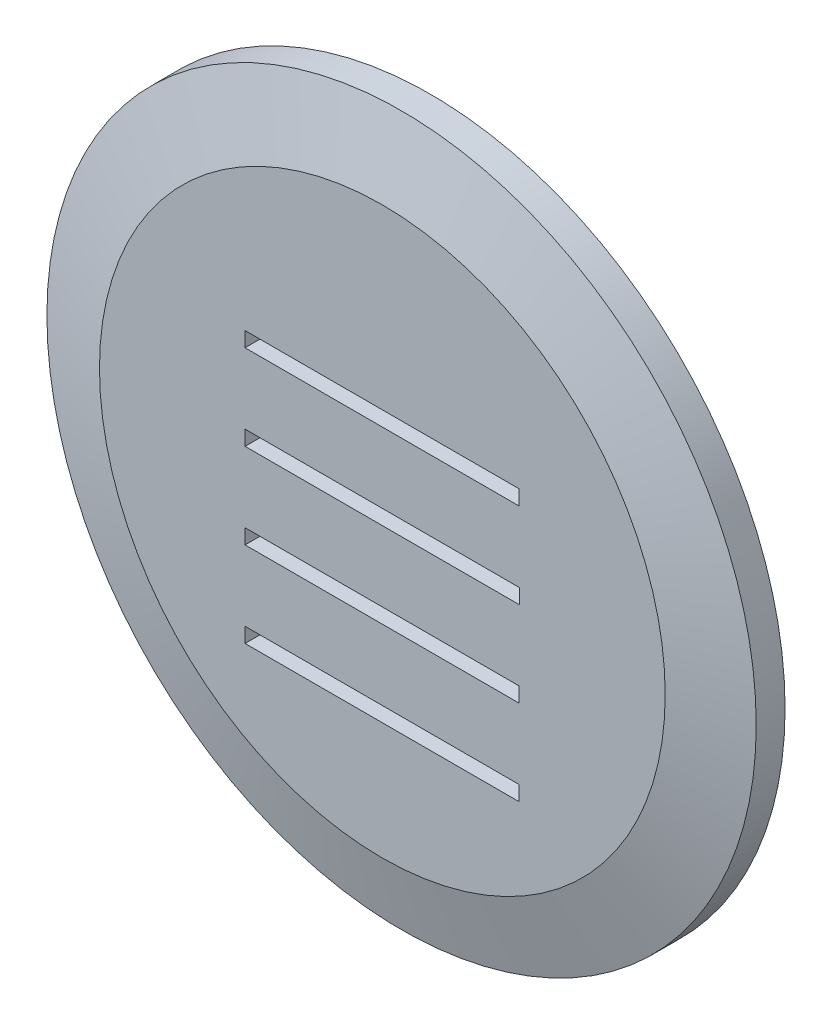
ISO-10303-21;
HEADER;
FILE_DESCRIPTION(('STEP AP214'),'2;1');
FILE_NAME('part.step','',(''),(''),'','','');
FILE_SCHEMA(('AUTOMOTIVE_DESIGN { 1 0 10303 214 1 1 1 1 }'));
ENDSEC;
DATA;
#1=APPLICATION_CONTEXT('core data for automotive mechanical design processes');
#2=APPLICATION_PROTOCOL_DEFINITION('international standard','automotive_design',2000,#1);
#3=PRODUCT_CONTEXT('',#1,'mechanical');
#4=PRODUCT('Part','Part','',(#3));
#5=PRODUCT_RELATED_PRODUCT_CATEGORY('part','',(#4));
#6=PRODUCT_DEFINITION_FORMATION('','',#4);
#7=PRODUCT_DEFINITION_CONTEXT('part definition',#1,'design');
#8=PRODUCT_DEFINITION('design','',#6,#7);
#9=PRODUCT_DEFINITION_SHAPE('','',#8);
#10=(LENGTH_UNIT() NAMED_UNIT(*) SI_UNIT(.MILLI.,.METRE.));
#11=(NAMED_UNIT(*) PLANE_ANGLE_UNIT() SI_UNIT($,.RADIAN.));
#12=(NAMED_UNIT(*) SI_UNIT($,.STERADIAN.) SOLID_ANGLE_UNIT());
#13=UNCERTAINTY_MEASURE_WITH_UNIT(LENGTH_MEASURE(1.E-05),#10,'distance_accuracy_value','');
#14=(GEOMETRIC_REPRESENTATION_CONTEXT(3) GLOBAL_UNCERTAINTY_ASSIGNED_CONTEXT((#13)) GLOBAL_UNIT_ASSIGNED_CONTEXT((#10,
#11,#12)) REPRESENTATION_CONTEXT('',''));
#15=CARTESIAN_POINT('',(0.,0.,0.));
#16=DIRECTION('',(0.,0.,1.));
#17=DIRECTION('',(1.,0.,0.));
#18=AXIS2_PLACEMENT_3D('',#15,#16,#17);
#19=CARTESIAN_POINT('',(0.,0.,-2.54));
#20=DIRECTION('',(0.,0.,1.));
#21=DIRECTION('',(1.,0.,0.));
#22=AXIS2_PLACEMENT_3D('',#19,#20,#21);
#23=CYLINDRICAL_SURFACE('',#22,23.0505);
#24=CARTESIAN_POINT('',(0.,0.,-2.54));
#25=DIRECTION('',(0.,0.,1.));
#26=DIRECTION('',(1.,0.,0.));
#27=AXIS2_PLACEMENT_3D('',#24,#25,#26);
#28=CIRCLE('',#27,23.0505);
#29=CARTESIAN_POINT('',(23.0505,0.,-2.54));
#30=VERTEX_POINT('',#29);
#31=EDGE_CURVE('E11',#30,#30,#28,.T.);
#32=ORIENTED_EDGE('',*,*,#31,.T.);
#33=EDGE_LOOP('',(#32));
#34=FACE_BOUND('',#33,.T.);
#35=CARTESIAN_POINT('',(0.,0.,0.127000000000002));
#36=DIRECTION('',(0.,0.,1.));
#37=DIRECTION('',(1.,0.,0.));
#38=AXIS2_PLACEMENT_3D('',#35,#36,#37);
#39=CIRCLE('',#38,23.0505);
#40=CARTESIAN_POINT('',(23.0505,0.,0.127000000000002));
#41=VERTEX_POINT('',#40);
#42=EDGE_CURVE('E272',#41,#41,#39,.T.);
#43=ORIENTED_EDGE('',*,*,#42,.F.);
#44=EDGE_LOOP('',(#43));
#45=FACE_BOUND('',#44,.T.);
#46=ADVANCED_FACE('F32',(#34,#45),#23,.T.);
#47=CARTESIAN_POINT('',(23.0505,0.,-2.54));
#48=DIRECTION('',(0.,0.,-1.));
#49=DIRECTION('',(-1.,0.,0.));
#50=AXIS2_PLACEMENT_3D('',#47,#48,#49);
#51=PLANE('',#50);
#52=DIRECTION('',(0.,-1.,0.));
#53=VECTOR('',#52,1.);
#54=CARTESIAN_POINT('',(-14.5034,2.1082,-2.54));
#55=LINE('',#54,#53);
#56=CARTESIAN_POINT('',(-14.5034,2.1082,-2.54));
#57=VERTEX_POINT('',#56);
#58=CARTESIAN_POINT('',(-14.5034,0.5334,-2.54));
#59=VERTEX_POINT('',#58);
#60=EDGE_CURVE('E148',#57,#59,#55,.T.);
#61=ORIENTED_EDGE('',*,*,#60,.T.);
#62=DIRECTION('',(1.,0.,0.));
#63=VECTOR('',#62,1.);
#64=CARTESIAN_POINT('',(-14.5034,0.5334,-2.54));
#65=LINE('',#64,#63);
#66=CARTESIAN_POINT('',(14.5034,0.5334,-2.54));
#67=VERTEX_POINT('',#66);
#68=EDGE_CURVE('E159',#59,#67,#65,.T.);
#69=ORIENTED_EDGE('',*,*,#68,.T.);
#70=DIRECTION('',(0.,1.,0.));
#71=VECTOR('',#70,1.);
#72=CARTESIAN_POINT('',(14.5034,2.1082,-2.54));
#73=LINE('',#72,#71);
#74=CARTESIAN_POINT('',(14.5034,2.1082,-2.54));
#75=VERTEX_POINT('',#74);
#76=EDGE_CURVE('E46',#67,#75,#73,.T.);
#77=ORIENTED_EDGE('',*,*,#76,.T.);
#78=DIRECTION('',(-1.,0.,0.));
#79=VECTOR('',#78,1.);
#80=CARTESIAN_POINT('',(-14.5034,2.1082,-2.54));
#81=LINE('',#80,#79);
#82=EDGE_CURVE('E156',#75,#57,#81,.T.);
#83=ORIENTED_EDGE('',*,*,#82,.T.);
#84=EDGE_LOOP('',(#61,#69,#77,#83));
#85=FACE_BOUND('',#84,.T.);
#86=DIRECTION('',(0.,-1.,0.));
#87=VECTOR('',#86,1.);
#88=CARTESIAN_POINT('',(-14.5034,-6.9088,-2.54));
#89=LINE('',#88,#87);
#90=CARTESIAN_POINT('',(-14.5034,-6.9088,-2.54));
#91=VERTEX_POINT('',#90);
#92=CARTESIAN_POINT('',(-14.5034,-8.4836,-2.54));
#93=VERTEX_POINT('',#92);
#94=EDGE_CURVE('E186',#91,#93,#89,.T.);
#95=ORIENTED_EDGE('',*,*,#94,.T.);
#96=DIRECTION('',(1.,0.,0.));
#97=VECTOR('',#96,1.);
#98=CARTESIAN_POINT('',(-14.5034,-8.4836,-2.54));
#99=LINE('',#98,#97);
#100=CARTESIAN_POINT('',(14.4526,-8.4836,-2.54));
#101=VERTEX_POINT('',#100);
#102=EDGE_CURVE('E189',#93,#101,#99,.T.);
#103=ORIENTED_EDGE('',*,*,#102,.T.);
#104=DIRECTION('',(0.,1.,0.));
#105=VECTOR('',#104,1.);
#106=CARTESIAN_POINT('',(14.4526,-6.9088,-2.54));
#107=LINE('',#106,#105);
#108=CARTESIAN_POINT('',(14.4526,-6.9088,-2.54));
#109=VERTEX_POINT('',#108);
#110=EDGE_CURVE('E54',#101,#109,#107,.T.);
#111=ORIENTED_EDGE('',*,*,#110,.T.);
#112=DIRECTION('',(-1.,0.,0.));
#113=VECTOR('',#112,1.);
#114=CARTESIAN_POINT('',(-14.5034,-6.9088,-2.54));
#115=LINE('',#114,#113);
#116=EDGE_CURVE('E194',#109,#91,#115,.T.);
#117=ORIENTED_EDGE('',*,*,#116,.T.);
#118=EDGE_LOOP('',(#95,#103,#111,#117));
#119=FACE_BOUND('',#118,.T.);
#120=DIRECTION('',(0.,-1.,0.));
#121=VECTOR('',#120,1.);
#122=CARTESIAN_POINT('',(-14.5034,-15.9258,-2.54));
#123=LINE('',#122,#121);
#124=CARTESIAN_POINT('',(-14.5034,-15.9258,-2.54));
#125=VERTEX_POINT('',#124);
#126=CARTESIAN_POINT('',(-14.5034,-17.5006,-2.54));
#127=VERTEX_POINT('',#126);
#128=EDGE_CURVE('E216',#125,#127,#123,.T.);
#129=ORIENTED_EDGE('',*,*,#128,.T.);
#130=DIRECTION('',(1.,0.,0.));
#131=VECTOR('',#130,1.);
#132=CARTESIAN_POINT('',(-14.5034,-17.5006,-2.54));
#133=LINE('',#132,#131);
#134=CARTESIAN_POINT('',(14.4526,-17.5006,-2.54));
#135=VERTEX_POINT('',#134);
#136=EDGE_CURVE('E219',#127,#135,#133,.T.);
#137=ORIENTED_EDGE('',*,*,#136,.T.);
#138=DIRECTION('',(0.,1.,0.));
#139=VECTOR('',#138,1.);
#140=CARTESIAN_POINT('',(14.4526,-15.9258,-2.54));
#141=LINE('',#140,#139);
#142=CARTESIAN_POINT('',(14.4526,-15.9258,-2.54));
#143=VERTEX_POINT('',#142);
#144=EDGE_CURVE('E223',#135,#143,#141,.T.);
#145=ORIENTED_EDGE('',*,*,#144,.T.);
#146=DIRECTION('',(-1.,0.,0.));
#147=VECTOR('',#146,1.);
#148=CARTESIAN_POINT('',(-14.5034,-15.9258,-2.54));
#149=LINE('',#148,#147);
#150=EDGE_CURVE('E226',#143,#125,#149,.T.);
#151=ORIENTED_EDGE('',*,*,#150,.T.);
#152=EDGE_LOOP('',(#129,#137,#145,#151));
#153=FACE_BOUND('',#152,.T.);
#154=DIRECTION('',(0.,-1.,0.));
#155=VECTOR('',#154,1.);
#156=CARTESIAN_POINT('',(-14.5034,11.1252,-2.54));
#157=LINE('',#156,#155);
#158=CARTESIAN_POINT('',(-14.5034,11.1252,-2.54));
#159=VERTEX_POINT('',#158);
#160=CARTESIAN_POINT('',(-14.5034,9.5504,-2.54));
#161=VERTEX_POINT('',#160);
#162=EDGE_CURVE('E247',#159,#161,#157,.T.);
#163=ORIENTED_EDGE('',*,*,#162,.T.);
#164=DIRECTION('',(1.,0.,0.));
#165=VECTOR('',#164,1.);
#166=CARTESIAN_POINT('',(-14.5034,9.5504,-2.54));
#167=LINE('',#166,#165);
#168=CARTESIAN_POINT('',(14.4526,9.5504,-2.54));
#169=VERTEX_POINT('',#168);
#170=EDGE_CURVE('E250',#161,#169,#167,.T.);
#171=ORIENTED_EDGE('',*,*,#170,.T.);
#172=DIRECTION('',(0.,1.,0.));
#173=VECTOR('',#172,1.);
#174=CARTESIAN_POINT('',(14.4526,11.1252,-2.54));
#175=LINE('',#174,#173);
#176=CARTESIAN_POINT('',(14.4526,11.1252,-2.54));
#177=VERTEX_POINT('',#176);
#178=EDGE_CURVE('E254',#169,#177,#175,.T.);
#179=ORIENTED_EDGE('',*,*,#178,.T.);
#180=DIRECTION('',(-1.,0.,0.));
#181=VECTOR('',#180,1.);
#182=CARTESIAN_POINT('',(-14.5034,11.1252,-2.54));
#183=LINE('',#182,#181);
#184=EDGE_CURVE('E257',#177,#159,#183,.T.);
#185=ORIENTED_EDGE('',*,*,#184,.T.);
#186=EDGE_LOOP('',(#163,#171,#179,#185));
#187=FACE_BOUND('',#186,.T.);
#188=ORIENTED_EDGE('',*,*,#31,.F.);
#189=EDGE_LOOP('',(#188));
#190=FACE_BOUND('',#189,.T.);
#191=ADVANCED_FACE('F163',(#85,#119,#153,#187,#190),#51,.T.);
#192=CARTESIAN_POINT('',(0.,0.,2.54));
#193=DIRECTION('',(0.,0.,1.));
#194=DIRECTION('',(1.,0.,0.));
#195=AXIS2_PLACEMENT_3D('',#192,#193,#194);
#196=PLANE('',#195);
#197=DIRECTION('',(0.,-1.,0.));
#198=VECTOR('',#197,1.);
#199=CARTESIAN_POINT('',(-14.5034,2.1082,2.54));
#200=LINE('',#199,#198);
#201=CARTESIAN_POINT('',(-14.5034,2.1082,2.54));
#202=VERTEX_POINT('',#201);
#203=CARTESIAN_POINT('',(-14.5034,0.5334,2.54));
#204=VERTEX_POINT('',#203);
#205=EDGE_CURVE('E151',#202,#204,#200,.T.);
#206=ORIENTED_EDGE('',*,*,#205,.F.);
#207=DIRECTION('',(-1.,0.,0.));
#208=VECTOR('',#207,1.);
#209=CARTESIAN_POINT('',(-14.5034,2.1082,2.54));
#210=LINE('',#209,#208);
#211=CARTESIAN_POINT('',(14.5034,2.1082,2.54));
#212=VERTEX_POINT('',#211);
#213=EDGE_CURVE('E166',#212,#202,#210,.T.);
#214=ORIENTED_EDGE('',*,*,#213,.F.);
#215=DIRECTION('',(0.,1.,0.));
#216=VECTOR('',#215,1.);
#217=CARTESIAN_POINT('',(14.5034,2.1082,2.54));
#218=LINE('',#217,#216);
#219=CARTESIAN_POINT('',(14.5034,0.5334,2.54));
#220=VERTEX_POINT('',#219);
#221=EDGE_CURVE('E169',#220,#212,#218,.T.);
#222=ORIENTED_EDGE('',*,*,#221,.F.);
#223=DIRECTION('',(1.,0.,0.));
#224=VECTOR('',#223,1.);
#225=CARTESIAN_POINT('',(-14.5034,0.5334,2.54));
#226=LINE('',#225,#224);
#227=EDGE_CURVE('E175',#204,#220,#226,.T.);
#228=ORIENTED_EDGE('',*,*,#227,.F.);
#229=EDGE_LOOP('',(#206,#214,#222,#228));
#230=FACE_BOUND('',#229,.T.);
#231=DIRECTION('',(0.,-1.,0.));
#232=VECTOR('',#231,1.);
#233=CARTESIAN_POINT('',(-14.5034,-6.9088,2.54));
#234=LINE('',#233,#232);
#235=CARTESIAN_POINT('',(-14.5034,-6.9088,2.54));
#236=VERTEX_POINT('',#235);
#237=CARTESIAN_POINT('',(-14.5034,-8.4836,2.54));
#238=VERTEX_POINT('',#237);
#239=EDGE_CURVE('E198',#236,#238,#234,.T.);
#240=ORIENTED_EDGE('',*,*,#239,.F.);
#241=DIRECTION('',(-1.,0.,0.));
#242=VECTOR('',#241,1.);
#243=CARTESIAN_POINT('',(-14.5034,-6.9088,2.54));
#244=LINE('',#243,#242);
#245=CARTESIAN_POINT('',(14.4526,-6.9088,2.54));
#246=VERTEX_POINT('',#245);
#247=EDGE_CURVE('E190',#246,#236,#244,.T.);
#248=ORIENTED_EDGE('',*,*,#247,.F.);
#249=DIRECTION('',(0.,1.,0.));
#250=VECTOR('',#249,1.);
#251=CARTESIAN_POINT('',(14.4526,-6.9088,2.54));
#252=LINE('',#251,#250);
#253=CARTESIAN_POINT('',(14.4526,-8.4836,2.54));
#254=VERTEX_POINT('',#253);
#255=EDGE_CURVE('E204',#254,#246,#252,.T.);
#256=ORIENTED_EDGE('',*,*,#255,.F.);
#257=DIRECTION('',(1.,0.,0.));
#258=VECTOR('',#257,1.);
#259=CARTESIAN_POINT('',(-14.5034,-8.4836,2.54));
#260=LINE('',#259,#258);
#261=EDGE_CURVE('E200',#238,#254,#260,.T.);
#262=ORIENTED_EDGE('',*,*,#261,.F.);
#263=EDGE_LOOP('',(#240,#248,#256,#262));
#264=FACE_BOUND('',#263,.T.);
#265=DIRECTION('',(0.,-1.,0.));
#266=VECTOR('',#265,1.);
#267=CARTESIAN_POINT('',(-14.5034,-15.9258,2.54));
#268=LINE('',#267,#266);
#269=CARTESIAN_POINT('',(-14.5034,-15.9258,2.54));
#270=VERTEX_POINT('',#269);
#271=CARTESIAN_POINT('',(-14.5034,-17.5006,2.54));
#272=VERTEX_POINT('',#271);
#273=EDGE_CURVE('E230',#270,#272,#268,.T.);
#274=ORIENTED_EDGE('',*,*,#273,.F.);
#275=DIRECTION('',(-1.,0.,0.));
#276=VECTOR('',#275,1.);
#277=CARTESIAN_POINT('',(-14.5034,-15.9258,2.54));
#278=LINE('',#277,#276);
#279=CARTESIAN_POINT('',(14.4526,-15.9258,2.54));
#280=VERTEX_POINT('',#279);
#281=EDGE_CURVE('E220',#280,#270,#278,.T.);
#282=ORIENTED_EDGE('',*,*,#281,.F.);
#283=DIRECTION('',(0.,1.,0.));
#284=VECTOR('',#283,1.);
#285=CARTESIAN_POINT('',(14.4526,-15.9258,2.54));
#286=LINE('',#285,#284);
#287=CARTESIAN_POINT('',(14.4526,-17.5006,2.54));
#288=VERTEX_POINT('',#287);
#289=EDGE_CURVE('E235',#288,#280,#286,.T.);
#290=ORIENTED_EDGE('',*,*,#289,.F.);
#291=DIRECTION('',(1.,0.,0.));
#292=VECTOR('',#291,1.);
#293=CARTESIAN_POINT('',(-14.5034,-17.5006,2.54));
#294=LINE('',#293,#292);
#295=EDGE_CURVE('E232',#272,#288,#294,.T.);
#296=ORIENTED_EDGE('',*,*,#295,.F.);
#297=EDGE_LOOP('',(#274,#282,#290,#296));
#298=FACE_BOUND('',#297,.T.);
#299=DIRECTION('',(0.,-1.,0.));
#300=VECTOR('',#299,1.);
#301=CARTESIAN_POINT('',(-14.5034,11.1252,2.54));
#302=LINE('',#301,#300);
#303=CARTESIAN_POINT('',(-14.5034,11.1252,2.54));
#304=VERTEX_POINT('',#303);
#305=CARTESIAN_POINT('',(-14.5034,9.5504,2.54));
#306=VERTEX_POINT('',#305);
#307=EDGE_CURVE('E182',#304,#306,#302,.T.);
#308=ORIENTED_EDGE('',*,*,#307,.F.);
#309=DIRECTION('',(-1.,0.,0.));
#310=VECTOR('',#309,1.);
#311=CARTESIAN_POINT('',(-14.5034,11.1252,2.54));
#312=LINE('',#311,#310);
#313=CARTESIAN_POINT('',(14.4526,11.1252,2.54));
#314=VERTEX_POINT('',#313);
#315=EDGE_CURVE('E251',#314,#304,#312,.T.);
#316=ORIENTED_EDGE('',*,*,#315,.F.);
#317=DIRECTION('',(0.,1.,0.));
#318=VECTOR('',#317,1.);
#319=CARTESIAN_POINT('',(14.4526,11.1252,2.54));
#320=LINE('',#319,#318);
#321=CARTESIAN_POINT('',(14.4526,9.5504,2.54));
#322=VERTEX_POINT('',#321);
#323=EDGE_CURVE('E265',#322,#314,#320,.T.);
#324=ORIENTED_EDGE('',*,*,#323,.F.);
#325=DIRECTION('',(1.,0.,0.));
#326=VECTOR('',#325,1.);
#327=CARTESIAN_POINT('',(-14.5034,9.5504,2.54));
#328=LINE('',#327,#326);
#329=EDGE_CURVE('E262',#306,#322,#328,.T.);
#330=ORIENTED_EDGE('',*,*,#329,.F.);
#331=EDGE_LOOP('',(#308,#316,#324,#330));
#332=FACE_BOUND('',#331,.T.);
#333=CARTESIAN_POINT('',(0.,0.,2.54));
#334=DIRECTION('',(0.,0.,1.));
#335=DIRECTION('',(1.,0.,0.));
#336=AXIS2_PLACEMENT_3D('',#333,#334,#335);
#337=CIRCLE('',#336,29.88147275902);
#338=CARTESIAN_POINT('',(29.88147275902,0.,2.54));
#339=VERTEX_POINT('',#338);
#340=EDGE_CURVE('E39',#339,#339,#337,.T.);
#341=ORIENTED_EDGE('',*,*,#340,.T.);
#342=EDGE_LOOP('',(#341));
#343=FACE_BOUND('',#342,.T.);
#344=ADVANCED_FACE('F295',(#230,#264,#298,#332,#343),#196,.T.);
#345=CARTESIAN_POINT('',(0.,0.,2.54));
#346=DIRECTION('',(0.,0.,-1.));
#347=DIRECTION('',(-1.,0.,0.));
#348=AXIS2_PLACEMENT_3D('',#345,#346,#347);
#349=CONICAL_SURFACE('',#348,29.88147275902,1.30899693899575);
#350=CARTESIAN_POINT('',(0.,0.,0.507999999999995));
#351=DIRECTION('',(0.,0.,1.));
#352=DIRECTION('',(1.,0.,0.));
#353=AXIS2_PLACEMENT_3D('',#350,#351,#352);
#354=CIRCLE('',#353,37.465);
#355=CARTESIAN_POINT('',(37.465,0.,0.507999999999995));
#356=VERTEX_POINT('',#355);
#357=EDGE_CURVE('E290',#356,#356,#354,.T.);
#358=ORIENTED_EDGE('',*,*,#357,.T.);
#359=EDGE_LOOP('',(#358));
#360=FACE_BOUND('',#359,.T.);
#361=ORIENTED_EDGE('',*,*,#340,.F.);
#362=EDGE_LOOP('',(#361));
#363=FACE_BOUND('',#362,.T.);
#364=ADVANCED_FACE('F297',(#360,#363),#349,.T.);
#365=CARTESIAN_POINT('',(0.,0.,-2.54));
#366=DIRECTION('',(0.,0.,1.));
#367=DIRECTION('',(1.,0.,0.));
#368=AXIS2_PLACEMENT_3D('',#365,#366,#367);
#369=CYLINDRICAL_SURFACE('',#368,37.465);
#370=CARTESIAN_POINT('',(0.,0.,-2.54));
#371=DIRECTION('',(0.,0.,1.));
#372=DIRECTION('',(1.,0.,0.));
#373=AXIS2_PLACEMENT_3D('',#370,#371,#372);
#374=CIRCLE('',#373,37.465);
#375=CARTESIAN_POINT('',(37.465,0.,-2.54));
#376=VERTEX_POINT('',#375);
#377=EDGE_CURVE('E287',#376,#376,#374,.T.);
#378=ORIENTED_EDGE('',*,*,#377,.T.);
#379=EDGE_LOOP('',(#378));
#380=FACE_BOUND('',#379,.T.);
#381=ORIENTED_EDGE('',*,*,#357,.F.);
#382=EDGE_LOOP('',(#381));
#383=FACE_BOUND('',#382,.T.);
#384=ADVANCED_FACE('F299',(#380,#383),#369,.T.);
#385=CARTESIAN_POINT('',(37.465,0.,-2.54));
#386=DIRECTION('',(0.,0.,-1.));
#387=DIRECTION('',(-1.,0.,0.));
#388=AXIS2_PLACEMENT_3D('',#385,#386,#387);
#389=PLANE('',#388);
#390=CARTESIAN_POINT('',(0.,0.,-2.54));
#391=DIRECTION('',(0.,0.,1.));
#392=DIRECTION('',(1.,0.,0.));
#393=AXIS2_PLACEMENT_3D('',#390,#391,#392);
#394=CIRCLE('',#393,26.2255);
#395=CARTESIAN_POINT('',(26.2255,0.,-2.54));
#396=VERTEX_POINT('',#395);
#397=EDGE_CURVE('E284',#396,#396,#394,.T.);
#398=ORIENTED_EDGE('',*,*,#397,.T.);
#399=EDGE_LOOP('',(#398));
#400=FACE_BOUND('',#399,.T.);
#401=ORIENTED_EDGE('',*,*,#377,.F.);
#402=EDGE_LOOP('',(#401));
#403=FACE_BOUND('',#402,.T.);
#404=ADVANCED_FACE('F306',(#400,#403),#389,.T.);
#405=CARTESIAN_POINT('',(0.,0.,-2.54));
#406=DIRECTION('',(0.,0.,1.));
#407=DIRECTION('',(1.,0.,0.));
#408=AXIS2_PLACEMENT_3D('',#405,#406,#407);
#409=CYLINDRICAL_SURFACE('',#408,26.2255);
#410=CARTESIAN_POINT('',(0.,0.,0.127000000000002));
#411=DIRECTION('',(0.,0.,1.));
#412=DIRECTION('',(1.,0.,0.));
#413=AXIS2_PLACEMENT_3D('',#410,#411,#412);
#414=CIRCLE('',#413,26.2255);
#415=CARTESIAN_POINT('',(26.2255,0.,0.127000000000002));
#416=VERTEX_POINT('',#415);
#417=EDGE_CURVE('E281',#416,#416,#414,.T.);
#418=ORIENTED_EDGE('',*,*,#417,.T.);
#419=EDGE_LOOP('',(#418));
#420=FACE_BOUND('',#419,.T.);
#421=ORIENTED_EDGE('',*,*,#397,.F.);
#422=EDGE_LOOP('',(#421));
#423=FACE_BOUND('',#422,.T.);
#424=ADVANCED_FACE('F324',(#420,#423),#409,.F.);
#425=CARTESIAN_POINT('',(26.2255,0.,0.127000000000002));
#426=DIRECTION('',(0.,0.,-1.));
#427=DIRECTION('',(-1.,0.,0.));
#428=AXIS2_PLACEMENT_3D('',#425,#426,#427);
#429=PLANE('',#428);
#430=ORIENTED_EDGE('',*,*,#42,.T.);
#431=EDGE_LOOP('',(#430));
#432=FACE_BOUND('',#431,.T.);
#433=ORIENTED_EDGE('',*,*,#417,.F.);
#434=EDGE_LOOP('',(#433));
#435=FACE_BOUND('',#434,.T.);
#436=ADVANCED_FACE('F320',(#432,#435),#429,.T.);
#437=CARTESIAN_POINT('',(-14.5034,11.1252,-2.54));
#438=DIRECTION('',(-1.,0.,0.));
#439=DIRECTION('',(0.,0.,1.));
#440=AXIS2_PLACEMENT_3D('',#437,#438,#439);
#441=PLANE('',#440);
#442=ORIENTED_EDGE('',*,*,#307,.T.);
#443=DIRECTION('',(0.,0.,1.));
#444=VECTOR('',#443,1.);
#445=CARTESIAN_POINT('',(-14.5034,9.5504,-2.54));
#446=LINE('',#445,#444);
#447=EDGE_CURVE('E260',#161,#306,#446,.T.);
#448=ORIENTED_EDGE('',*,*,#447,.F.);
#449=ORIENTED_EDGE('',*,*,#162,.F.);
#450=DIRECTION('',(0.,0.,1.));
#451=VECTOR('',#450,1.);
#452=CARTESIAN_POINT('',(-14.5034,11.1252,-2.54));
#453=LINE('',#452,#451);
#454=EDGE_CURVE('E270',#159,#304,#453,.T.);
#455=ORIENTED_EDGE('',*,*,#454,.T.);
#456=EDGE_LOOP('',(#442,#448,#449,#455));
#457=FACE_BOUND('',#456,.T.);
#458=ADVANCED_FACE('F323',(#457),#441,.F.);
#459=CARTESIAN_POINT('',(-14.5034,11.1252,-2.54));
#460=DIRECTION('',(0.,1.,0.));
#461=DIRECTION('',(0.,0.,1.));
#462=AXIS2_PLACEMENT_3D('',#459,#460,#461);
#463=PLANE('',#462);
#464=ORIENTED_EDGE('',*,*,#315,.T.);
#465=ORIENTED_EDGE('',*,*,#454,.F.);
#466=ORIENTED_EDGE('',*,*,#184,.F.);
#467=DIRECTION('',(0.,0.,1.));
#468=VECTOR('',#467,1.);
#469=CARTESIAN_POINT('',(14.4526,11.1252,-2.54));
#470=LINE('',#469,#468);
#471=EDGE_CURVE('E273',#177,#314,#470,.T.);
#472=ORIENTED_EDGE('',*,*,#471,.T.);
#473=EDGE_LOOP('',(#464,#465,#466,#472));
#474=FACE_BOUND('',#473,.T.);
#475=ADVANCED_FACE('F344',(#474),#463,.F.);
#476=CARTESIAN_POINT('',(14.4526,11.1252,-2.54));
#477=DIRECTION('',(1.,0.,0.));
#478=DIRECTION('',(0.,0.,-1.));
#479=AXIS2_PLACEMENT_3D('',#476,#477,#478);
#480=PLANE('',#479);
#481=ORIENTED_EDGE('',*,*,#323,.T.);
#482=ORIENTED_EDGE('',*,*,#471,.F.);
#483=ORIENTED_EDGE('',*,*,#178,.F.);
#484=DIRECTION('',(0.,0.,1.));
#485=VECTOR('',#484,1.);
#486=CARTESIAN_POINT('',(14.4526,9.5504,-2.54));
#487=LINE('',#486,#485);
#488=EDGE_CURVE('E275',#169,#322,#487,.T.);
#489=ORIENTED_EDGE('',*,*,#488,.T.);
#490=EDGE_LOOP('',(#481,#482,#483,#489));
#491=FACE_BOUND('',#490,.T.);
#492=ADVANCED_FACE('F350',(#491),#480,.F.);
#493=CARTESIAN_POINT('',(-14.5034,9.5504,-2.54));
#494=DIRECTION('',(0.,-1.,0.));
#495=DIRECTION('',(0.,0.,-1.));
#496=AXIS2_PLACEMENT_3D('',#493,#494,#495);
#497=PLANE('',#496);
#498=ORIENTED_EDGE('',*,*,#329,.T.);
#499=ORIENTED_EDGE('',*,*,#488,.F.);
#500=ORIENTED_EDGE('',*,*,#170,.F.);
#501=ORIENTED_EDGE('',*,*,#447,.T.);
#502=EDGE_LOOP('',(#498,#499,#500,#501));
#503=FACE_BOUND('',#502,.T.);
#504=ADVANCED_FACE('F346',(#503),#497,.F.);
#505=CARTESIAN_POINT('',(-14.5034,-15.9258,-2.54));
#506=DIRECTION('',(-1.,0.,0.));
#507=DIRECTION('',(0.,0.,1.));
#508=AXIS2_PLACEMENT_3D('',#505,#506,#507);
#509=PLANE('',#508);
#510=ORIENTED_EDGE('',*,*,#273,.T.);
#511=DIRECTION('',(0.,0.,1.));
#512=VECTOR('',#511,1.);
#513=CARTESIAN_POINT('',(-14.5034,-17.5006,-2.54));
#514=LINE('',#513,#512);
#515=EDGE_CURVE('E229',#127,#272,#514,.T.);
#516=ORIENTED_EDGE('',*,*,#515,.F.);
#517=ORIENTED_EDGE('',*,*,#128,.F.);
#518=DIRECTION('',(0.,0.,1.));
#519=VECTOR('',#518,1.);
#520=CARTESIAN_POINT('',(-14.5034,-15.9258,-2.54));
#521=LINE('',#520,#519);
#522=EDGE_CURVE('E201',#125,#270,#521,.T.);
#523=ORIENTED_EDGE('',*,*,#522,.T.);
#524=EDGE_LOOP('',(#510,#516,#517,#523));
#525=FACE_BOUND('',#524,.T.);
#526=ADVANCED_FACE('F349',(#525),#509,.F.);
#527=CARTESIAN_POINT('',(-14.5034,-15.9258,-2.54));
#528=DIRECTION('',(0.,1.,0.));
#529=DIRECTION('',(0.,0.,1.));
#530=AXIS2_PLACEMENT_3D('',#527,#528,#529);
#531=PLANE('',#530);
#532=ORIENTED_EDGE('',*,*,#281,.T.);
#533=ORIENTED_EDGE('',*,*,#522,.F.);
#534=ORIENTED_EDGE('',*,*,#150,.F.);
#535=DIRECTION('',(0.,0.,1.));
#536=VECTOR('',#535,1.);
#537=CARTESIAN_POINT('',(14.4526,-15.9258,-2.54));
#538=LINE('',#537,#536);
#539=EDGE_CURVE('E241',#143,#280,#538,.T.);
#540=ORIENTED_EDGE('',*,*,#539,.T.);
#541=EDGE_LOOP('',(#532,#533,#534,#540));
#542=FACE_BOUND('',#541,.T.);
#543=ADVANCED_FACE('F360',(#542),#531,.F.);
#544=CARTESIAN_POINT('',(14.4526,-15.9258,-2.54));
#545=DIRECTION('',(1.,0.,0.));
#546=DIRECTION('',(0.,0.,-1.));
#547=AXIS2_PLACEMENT_3D('',#544,#545,#546);
#548=PLANE('',#547);
#549=ORIENTED_EDGE('',*,*,#289,.T.);
#550=ORIENTED_EDGE('',*,*,#539,.F.);
#551=ORIENTED_EDGE('',*,*,#144,.F.);
#552=DIRECTION('',(0.,0.,1.));
#553=VECTOR('',#552,1.);
#554=CARTESIAN_POINT('',(14.4526,-17.5006,-2.54));
#555=LINE('',#554,#553);
#556=EDGE_CURVE('E243',#135,#288,#555,.T.);
#557=ORIENTED_EDGE('',*,*,#556,.T.);
#558=EDGE_LOOP('',(#549,#550,#551,#557));
#559=FACE_BOUND('',#558,.T.);
#560=ADVANCED_FACE('F366',(#559),#548,.F.);
#561=CARTESIAN_POINT('',(-14.5034,-17.5006,-2.54));
#562=DIRECTION('',(0.,-1.,0.));
#563=DIRECTION('',(0.,0.,-1.));
#564=AXIS2_PLACEMENT_3D('',#561,#562,#563);
#565=PLANE('',#564);
#566=ORIENTED_EDGE('',*,*,#295,.T.);
#567=ORIENTED_EDGE('',*,*,#556,.F.);
#568=ORIENTED_EDGE('',*,*,#136,.F.);
#569=ORIENTED_EDGE('',*,*,#515,.T.);
#570=EDGE_LOOP('',(#566,#567,#568,#569));
#571=FACE_BOUND('',#570,.T.);
#572=ADVANCED_FACE('F362',(#571),#565,.F.);
#573=CARTESIAN_POINT('',(-14.5034,-6.9088,-2.54));
#574=DIRECTION('',(-1.,0.,0.));
#575=DIRECTION('',(0.,0.,1.));
#576=AXIS2_PLACEMENT_3D('',#573,#574,#575);
#577=PLANE('',#576);
#578=ORIENTED_EDGE('',*,*,#239,.T.);
#579=DIRECTION('',(0.,0.,1.));
#580=VECTOR('',#579,1.);
#581=CARTESIAN_POINT('',(-14.5034,-8.4836,-2.54));
#582=LINE('',#581,#580);
#583=EDGE_CURVE('E197',#93,#238,#582,.T.);
#584=ORIENTED_EDGE('',*,*,#583,.F.);
#585=ORIENTED_EDGE('',*,*,#94,.F.);
#586=DIRECTION('',(0.,0.,1.));
#587=VECTOR('',#586,1.);
#588=CARTESIAN_POINT('',(-14.5034,-6.9088,-2.54));
#589=LINE('',#588,#587);
#590=EDGE_CURVE('E176',#91,#236,#589,.T.);
#591=ORIENTED_EDGE('',*,*,#590,.T.);
#592=EDGE_LOOP('',(#578,#584,#585,#591));
#593=FACE_BOUND('',#592,.T.);
#594=ADVANCED_FACE('F365',(#593),#577,.F.);
#595=CARTESIAN_POINT('',(-14.5034,-6.9088,-2.54));
#596=DIRECTION('',(0.,1.,0.));
#597=DIRECTION('',(0.,0.,1.));
#598=AXIS2_PLACEMENT_3D('',#595,#596,#597);
#599=PLANE('',#598);
#600=ORIENTED_EDGE('',*,*,#247,.T.);
#601=ORIENTED_EDGE('',*,*,#590,.F.);
#602=ORIENTED_EDGE('',*,*,#116,.F.);
#603=DIRECTION('',(0.,0.,1.));
#604=VECTOR('',#603,1.);
#605=CARTESIAN_POINT('',(14.4526,-6.9088,-2.54));
#606=LINE('',#605,#604);
#607=EDGE_CURVE('E210',#109,#246,#606,.T.);
#608=ORIENTED_EDGE('',*,*,#607,.T.);
#609=EDGE_LOOP('',(#600,#601,#602,#608));
#610=FACE_BOUND('',#609,.T.);
#611=ADVANCED_FACE('F376',(#610),#599,.F.);
#612=CARTESIAN_POINT('',(14.4526,-6.9088,-2.54));
#613=DIRECTION('',(1.,0.,0.));
#614=DIRECTION('',(0.,0.,-1.));
#615=AXIS2_PLACEMENT_3D('',#612,#613,#614);
#616=PLANE('',#615);
#617=ORIENTED_EDGE('',*,*,#255,.T.);
#618=ORIENTED_EDGE('',*,*,#607,.F.);
#619=ORIENTED_EDGE('',*,*,#110,.F.);
#620=DIRECTION('',(0.,0.,1.));
#621=VECTOR('',#620,1.);
#622=CARTESIAN_POINT('',(14.4526,-8.4836,-2.54));
#623=LINE('',#622,#621);
#624=EDGE_CURVE('E212',#101,#254,#623,.T.);
#625=ORIENTED_EDGE('',*,*,#624,.T.);
#626=EDGE_LOOP('',(#617,#618,#619,#625));
#627=FACE_BOUND('',#626,.T.);
#628=ADVANCED_FACE('F381',(#627),#616,.F.);
#629=CARTESIAN_POINT('',(-14.5034,-8.4836,-2.54));
#630=DIRECTION('',(0.,-1.,0.));
#631=DIRECTION('',(0.,0.,-1.));
#632=AXIS2_PLACEMENT_3D('',#629,#630,#631);
#633=PLANE('',#632);
#634=ORIENTED_EDGE('',*,*,#261,.T.);
#635=ORIENTED_EDGE('',*,*,#624,.F.);
#636=ORIENTED_EDGE('',*,*,#102,.F.);
#637=ORIENTED_EDGE('',*,*,#583,.T.);
#638=EDGE_LOOP('',(#634,#635,#636,#637));
#639=FACE_BOUND('',#638,.T.);
#640=ADVANCED_FACE('F378',(#639),#633,.F.);
#641=CARTESIAN_POINT('',(-14.5034,2.1082,-2.54));
#642=DIRECTION('',(-1.,0.,0.));
#643=DIRECTION('',(0.,0.,1.));
#644=AXIS2_PLACEMENT_3D('',#641,#642,#643);
#645=PLANE('',#644);
#646=ORIENTED_EDGE('',*,*,#205,.T.);
#647=DIRECTION('',(0.,0.,1.));
#648=VECTOR('',#647,1.);
#649=CARTESIAN_POINT('',(-14.5034,0.5334,-2.54));
#650=LINE('',#649,#648);
#651=EDGE_CURVE('E144',#59,#204,#650,.T.);
#652=ORIENTED_EDGE('',*,*,#651,.F.);
#653=ORIENTED_EDGE('',*,*,#60,.F.);
#654=DIRECTION('',(0.,0.,1.));
#655=VECTOR('',#654,1.);
#656=CARTESIAN_POINT('',(-14.5034,2.1082,-2.54));
#657=LINE('',#656,#655);
#658=EDGE_CURVE('E180',#57,#202,#657,.T.);
#659=ORIENTED_EDGE('',*,*,#658,.T.);
#660=EDGE_LOOP('',(#646,#652,#653,#659));
#661=FACE_BOUND('',#660,.T.);
#662=ADVANCED_FACE('F146',(#661),#645,.F.);
#663=CARTESIAN_POINT('',(-14.5034,2.1082,-2.54));
#664=DIRECTION('',(0.,1.,0.));
#665=DIRECTION('',(0.,0.,1.));
#666=AXIS2_PLACEMENT_3D('',#663,#664,#665);
#667=PLANE('',#666);
#668=ORIENTED_EDGE('',*,*,#213,.T.);
#669=ORIENTED_EDGE('',*,*,#658,.F.);
#670=ORIENTED_EDGE('',*,*,#82,.F.);
#671=DIRECTION('',(0.,0.,1.));
#672=VECTOR('',#671,1.);
#673=CARTESIAN_POINT('',(14.5034,2.1082,-2.54));
#674=LINE('',#673,#672);
#675=EDGE_CURVE('E183',#75,#212,#674,.T.);
#676=ORIENTED_EDGE('',*,*,#675,.T.);
#677=EDGE_LOOP('',(#668,#669,#670,#676));
#678=FACE_BOUND('',#677,.T.);
#679=ADVANCED_FACE('F390',(#678),#667,.F.);
#680=CARTESIAN_POINT('',(14.5034,2.1082,-2.54));
#681=DIRECTION('',(1.,0.,0.));
#682=DIRECTION('',(0.,0.,-1.));
#683=AXIS2_PLACEMENT_3D('',#680,#681,#682);
#684=PLANE('',#683);
#685=ORIENTED_EDGE('',*,*,#221,.T.);
#686=ORIENTED_EDGE('',*,*,#675,.F.);
#687=ORIENTED_EDGE('',*,*,#76,.F.);
#688=DIRECTION('',(0.,0.,1.));
#689=VECTOR('',#688,1.);
#690=CARTESIAN_POINT('',(14.5034,0.5334,-2.54));
#691=LINE('',#690,#689);
#692=EDGE_CURVE('E155',#67,#220,#691,.T.);
#693=ORIENTED_EDGE('',*,*,#692,.T.);
#694=EDGE_LOOP('',(#685,#686,#687,#693));
#695=FACE_BOUND('',#694,.T.);
#696=ADVANCED_FACE('F393',(#695),#684,.F.);
#697=CARTESIAN_POINT('',(-14.5034,0.5334,-2.54));
#698=DIRECTION('',(0.,-1.,0.));
#699=DIRECTION('',(0.,0.,-1.));
#700=AXIS2_PLACEMENT_3D('',#697,#698,#699);
#701=PLANE('',#700);
#702=ORIENTED_EDGE('',*,*,#227,.T.);
#703=ORIENTED_EDGE('',*,*,#692,.F.);
#704=ORIENTED_EDGE('',*,*,#68,.F.);
#705=ORIENTED_EDGE('',*,*,#651,.T.);
#706=EDGE_LOOP('',(#702,#703,#704,#705));
#707=FACE_BOUND('',#706,.T.);
#708=ADVANCED_FACE('F160',(#707),#701,.F.);
#709=CLOSED_SHELL('',(#46,#191,#344,#364,#384,#404,#424,#436,#458,#475,#492,#504,#526,#543,#560,
#572,#594,#611,#628,#640,#662,#679,#696,#708));
#710=MANIFOLD_SOLID_BREP('B2',#709);
#711=ADVANCED_BREP_SHAPE_REPRESENTATION('',(#18,#710),#14);
#712=SHAPE_DEFINITION_REPRESENTATION(#9,#711);
ENDSEC;
END-ISO-10303-21;
